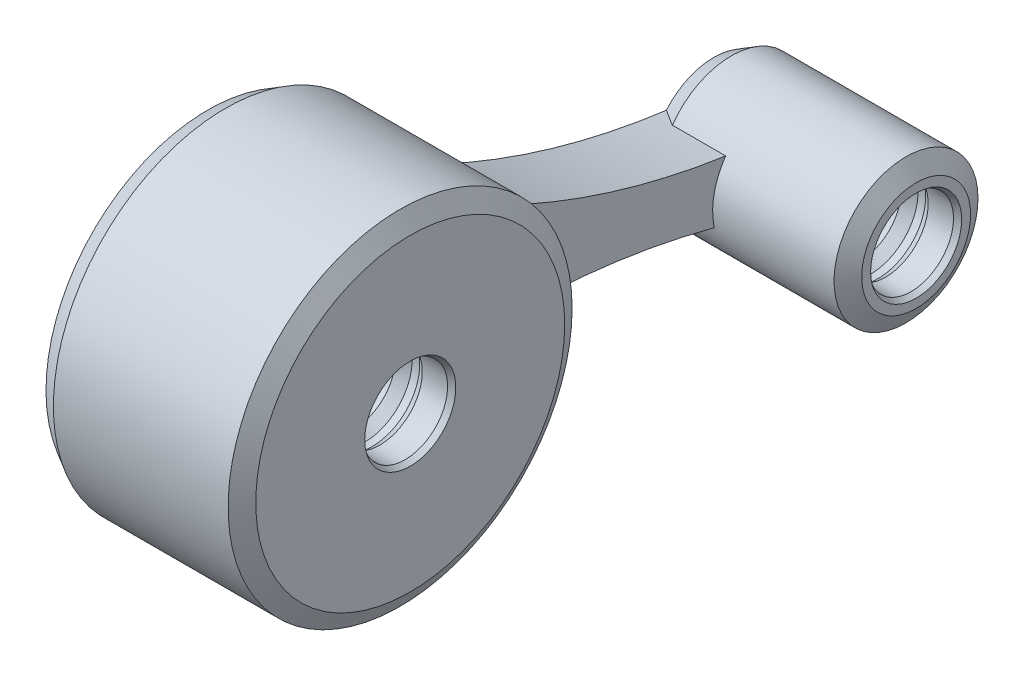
ISO-10303-21;
HEADER;
FILE_DESCRIPTION(('STEP AP214'),'2;1');
FILE_NAME('part.step','',(''),(''),'','','');
FILE_SCHEMA(('AUTOMOTIVE_DESIGN { 1 0 10303 214 1 1 1 1 }'));
ENDSEC;
DATA;
#1=APPLICATION_CONTEXT('core data for automotive mechanical design processes');
#2=APPLICATION_PROTOCOL_DEFINITION('international standard','automotive_design',2000,#1);
#3=PRODUCT_CONTEXT('',#1,'mechanical');
#4=PRODUCT('Part','Part','',(#3));
#5=PRODUCT_RELATED_PRODUCT_CATEGORY('part','',(#4));
#6=PRODUCT_DEFINITION_FORMATION('','',#4);
#7=PRODUCT_DEFINITION_CONTEXT('part definition',#1,'design');
#8=PRODUCT_DEFINITION('design','',#6,#7);
#9=PRODUCT_DEFINITION_SHAPE('','',#8);
#10=(LENGTH_UNIT() NAMED_UNIT(*) SI_UNIT(.MILLI.,.METRE.));
#11=(NAMED_UNIT(*) PLANE_ANGLE_UNIT() SI_UNIT($,.RADIAN.));
#12=(NAMED_UNIT(*) SI_UNIT($,.STERADIAN.) SOLID_ANGLE_UNIT());
#13=UNCERTAINTY_MEASURE_WITH_UNIT(LENGTH_MEASURE(1.E-05),#10,'distance_accuracy_value','');
#14=(GEOMETRIC_REPRESENTATION_CONTEXT(3) GLOBAL_UNCERTAINTY_ASSIGNED_CONTEXT((#13)) GLOBAL_UNIT_ASSIGNED_CONTEXT((#10,
#11,#12)) REPRESENTATION_CONTEXT('',''));
#15=CARTESIAN_POINT('',(0.,0.,0.));
#16=DIRECTION('',(0.,0.,1.));
#17=DIRECTION('',(1.,0.,0.));
#18=AXIS2_PLACEMENT_3D('',#15,#16,#17);
#19=CARTESIAN_POINT('',(20.,0.,0.));
#20=DIRECTION('',(1.,0.,0.));
#21=DIRECTION('',(0.,0.,-1.));
#22=AXIS2_PLACEMENT_3D('',#19,#20,#21);
#23=PLANE('',#22);
#24=CARTESIAN_POINT('',(20.,0.,0.));
#25=DIRECTION('',(1.,0.,0.));
#26=DIRECTION('',(0.,0.,-1.));
#27=AXIS2_PLACEMENT_3D('',#24,#25,#26);
#28=CIRCLE('',#27,5.38218136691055);
#29=CARTESIAN_POINT('',(20.,0.,-5.38218136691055));
#30=VERTEX_POINT('',#29);
#31=EDGE_CURVE('E129',#30,#30,#28,.T.);
#32=ORIENTED_EDGE('',*,*,#31,.T.);
#33=EDGE_LOOP('',(#32));
#34=FACE_BOUND('',#33,.T.);
#35=CARTESIAN_POINT('',(20.,0.,0.));
#36=DIRECTION('',(-1.,0.,0.));
#37=DIRECTION('',(0.,0.,1.));
#38=AXIS2_PLACEMENT_3D('',#35,#36,#37);
#39=CIRCLE('',#38,4.5);
#40=CARTESIAN_POINT('',(20.,0.,4.5));
#41=VERTEX_POINT('',#40);
#42=EDGE_CURVE('E225',#41,#41,#39,.T.);
#43=ORIENTED_EDGE('',*,*,#42,.T.);
#44=EDGE_LOOP('',(#43));
#45=FACE_BOUND('',#44,.T.);
#46=ADVANCED_FACE('F42',(#34,#45),#23,.T.);
#47=CARTESIAN_POINT('',(20.,10.6190847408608,50.));
#48=DIRECTION('',(1.,0.,0.));
#49=DIRECTION('',(0.,0.,-1.));
#50=AXIS2_PLACEMENT_3D('',#47,#48,#49);
#51=PLANE('',#50);
#52=CARTESIAN_POINT('',(20.,10.6190847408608,50.));
#53=DIRECTION('',(1.,0.,0.));
#54=DIRECTION('',(0.,0.,-1.));
#55=AXIS2_PLACEMENT_3D('',#52,#53,#54);
#56=CIRCLE('',#55,15.2679491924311);
#57=CARTESIAN_POINT('',(20.,10.6190847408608,34.7320508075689));
#58=VERTEX_POINT('',#57);
#59=EDGE_CURVE('E188',#58,#58,#56,.T.);
#60=ORIENTED_EDGE('',*,*,#59,.T.);
#61=EDGE_LOOP('',(#60));
#62=FACE_BOUND('',#61,.T.);
#63=CARTESIAN_POINT('',(20.,10.6190847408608,50.));
#64=DIRECTION('',(-1.,0.,0.));
#65=DIRECTION('',(0.,0.,1.));
#66=AXIS2_PLACEMENT_3D('',#63,#64,#65);
#67=CIRCLE('',#66,4.5);
#68=CARTESIAN_POINT('',(20.,10.6190847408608,54.5));
#69=VERTEX_POINT('',#68);
#70=EDGE_CURVE('E260',#69,#69,#67,.T.);
#71=ORIENTED_EDGE('',*,*,#70,.T.);
#72=EDGE_LOOP('',(#71));
#73=FACE_BOUND('',#72,.T.);
#74=ADVANCED_FACE('F222',(#62,#73),#51,.T.);
#75=CARTESIAN_POINT('',(0.,0.,0.));
#76=DIRECTION('',(1.,0.,0.));
#77=DIRECTION('',(0.,0.,-1.));
#78=AXIS2_PLACEMENT_3D('',#75,#76,#77);
#79=PLANE('',#78);
#80=CARTESIAN_POINT('',(0.,10.6190847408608,50.));
#81=DIRECTION('',(-1.,0.,0.));
#82=DIRECTION('',(0.,0.,1.));
#83=AXIS2_PLACEMENT_3D('',#80,#81,#82);
#84=CIRCLE('',#83,4.5);
#85=CARTESIAN_POINT('',(0.,10.6190847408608,54.5));
#86=VERTEX_POINT('',#85);
#87=EDGE_CURVE('E315',#86,#86,#84,.T.);
#88=ORIENTED_EDGE('',*,*,#87,.F.);
#89=EDGE_LOOP('',(#88));
#90=FACE_BOUND('',#89,.T.);
#91=CARTESIAN_POINT('',(0.,-79.2534363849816,27.4855740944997));
#92=DIRECTION('',(-1.,0.,0.));
#93=DIRECTION('',(0.,0.,-1.));
#94=AXIS2_PLACEMENT_3D('',#91,#92,#93);
#95=CIRCLE('',#94,80.4312519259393);
#96=CARTESIAN_POINT('',(0.,0.542951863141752,37.5713417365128));
#97=VERTEX_POINT('',#96);
#98=CARTESIAN_POINT('',(0.,-1.78755789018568,5.84709088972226));
#99=VERTEX_POINT('',#98);
#100=EDGE_CURVE('E105',#97,#99,#95,.T.);
#101=ORIENTED_EDGE('',*,*,#100,.F.);
#102=CARTESIAN_POINT('',(0.,10.6190847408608,50.));
#103=DIRECTION('',(1.,0.,0.));
#104=DIRECTION('',(0.,0.,-1.));
#105=AXIS2_PLACEMENT_3D('',#102,#103,#104);
#106=CIRCLE('',#105,16.);
#107=CARTESIAN_POINT('',(0.,14.5561375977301,34.4919500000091));
#108=VERTEX_POINT('',#107);
#109=EDGE_CURVE('E326',#97,#108,#106,.F.);
#110=ORIENTED_EDGE('',*,*,#109,.T.);
#111=CARTESIAN_POINT('',(0.,78.5679863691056,-5.13014934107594));
#112=DIRECTION('',(-1.,0.,0.));
#113=DIRECTION('',(0.,0.,-1.));
#114=AXIS2_PLACEMENT_3D('',#111,#112,#113);
#115=CIRCLE('',#114,75.2823189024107);
#116=CARTESIAN_POINT('',(0.,3.92829293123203,4.685333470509));
#117=VERTEX_POINT('',#116);
#118=EDGE_CURVE('E67',#117,#108,#115,.T.);
#119=ORIENTED_EDGE('',*,*,#118,.F.);
#120=CARTESIAN_POINT('',(0.,0.,0.));
#121=DIRECTION('',(1.,0.,0.));
#122=DIRECTION('',(0.,0.,-1.));
#123=AXIS2_PLACEMENT_3D('',#120,#121,#122);
#124=CIRCLE('',#123,6.11423217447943);
#125=EDGE_CURVE('E124',#117,#99,#124,.F.);
#126=ORIENTED_EDGE('',*,*,#125,.T.);
#127=EDGE_LOOP('',(#101,#110,#119,#126));
#128=FACE_BOUND('',#127,.T.);
#129=CARTESIAN_POINT('',(0.,0.,0.));
#130=DIRECTION('',(-1.,0.,0.));
#131=DIRECTION('',(0.,0.,1.));
#132=AXIS2_PLACEMENT_3D('',#129,#130,#131);
#133=CIRCLE('',#132,4.5);
#134=CARTESIAN_POINT('',(0.,0.,4.5));
#135=VERTEX_POINT('',#134);
#136=EDGE_CURVE('E287',#135,#135,#133,.T.);
#137=ORIENTED_EDGE('',*,*,#136,.F.);
#138=EDGE_LOOP('',(#137));
#139=FACE_BOUND('',#138,.T.);
#140=ADVANCED_FACE('F131',(#90,#128,#139),#79,.F.);
#141=CARTESIAN_POINT('',(6.99999999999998,39.2839931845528,-2.56507467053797));
#142=DIRECTION('',(1.,0.,0.));
#143=DIRECTION('',(0.,0.,-1.));
#144=AXIS2_PLACEMENT_3D('',#141,#142,#143);
#145=PLANE('',#144);
#146=CARTESIAN_POINT('',(6.99999999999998,78.5679863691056,-5.13014934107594));
#147=DIRECTION('',(-1.,0.,0.));
#148=DIRECTION('',(0.,0.,-1.));
#149=AXIS2_PLACEMENT_3D('',#146,#147,#148);
#150=CIRCLE('',#149,75.2823189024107);
#151=CARTESIAN_POINT('',(6.99999999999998,4.08678037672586,5.82327447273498));
#152=VERTEX_POINT('',#151);
#153=CARTESIAN_POINT('',(6.99999999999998,13.8379888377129,33.3075269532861));
#154=VERTEX_POINT('',#153);
#155=EDGE_CURVE('E117',#152,#154,#150,.T.);
#156=ORIENTED_EDGE('',*,*,#155,.T.);
#157=CARTESIAN_POINT('',(6.99999999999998,10.6190847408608,50.));
#158=DIRECTION('',(1.,0.,0.));
#159=DIRECTION('',(0.,0.,-1.));
#160=AXIS2_PLACEMENT_3D('',#157,#158,#159);
#161=CIRCLE('',#160,17.);
#162=CARTESIAN_POINT('',(6.99999999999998,0.705437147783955,36.1898735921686));
#163=VERTEX_POINT('',#162);
#164=EDGE_CURVE('E187',#154,#163,#161,.F.);
#165=ORIENTED_EDGE('',*,*,#164,.T.);
#166=CARTESIAN_POINT('',(6.99999999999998,-79.2534363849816,27.4855740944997));
#167=DIRECTION('',(-1.,0.,0.));
#168=DIRECTION('',(0.,0.,-1.));
#169=AXIS2_PLACEMENT_3D('',#166,#167,#168);
#170=CIRCLE('',#169,80.4312519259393);
#171=CARTESIAN_POINT('',(6.99999999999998,-1.48598416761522,6.95730914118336));
#172=VERTEX_POINT('',#171);
#173=EDGE_CURVE('E198',#163,#172,#170,.T.);
#174=ORIENTED_EDGE('',*,*,#173,.T.);
#175=CARTESIAN_POINT('',(6.99999999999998,0.,0.));
#176=DIRECTION('',(1.,0.,0.));
#177=DIRECTION('',(0.,0.,-1.));
#178=AXIS2_PLACEMENT_3D('',#175,#176,#177);
#179=CIRCLE('',#178,7.11423217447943);
#180=EDGE_CURVE('E170',#152,#172,#179,.T.);
#181=ORIENTED_EDGE('',*,*,#180,.F.);
#182=EDGE_LOOP('',(#156,#165,#174,#181));
#183=FACE_BOUND('',#182,.T.);
#184=ADVANCED_FACE('F160',(#183),#145,.T.);
#185=CARTESIAN_POINT('',(6.99999999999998,78.5679863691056,-5.13014934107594));
#186=DIRECTION('',(-1.,0.,0.));
#187=DIRECTION('',(0.,0.,1.));
#188=AXIS2_PLACEMENT_3D('',#185,#186,#187);
#189=CYLINDRICAL_SURFACE('',#188,75.2823189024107);
#190=DIRECTION('',(-1.,0.,0.));
#191=VECTOR('',#190,1.);
#192=CARTESIAN_POINT('',(10.3660254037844,13.837988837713,33.3075269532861));
#193=LINE('',#192,#191);
#194=CARTESIAN_POINT('',(1.73205080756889,13.8379888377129,33.3075269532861));
#195=VERTEX_POINT('',#194);
#196=EDGE_CURVE('E192',#154,#195,#193,.T.);
#197=ORIENTED_EDGE('',*,*,#196,.F.);
#198=ORIENTED_EDGE('',*,*,#155,.F.);
#199=DIRECTION('',(-1.,0.,0.));
#200=VECTOR('',#199,1.);
#201=CARTESIAN_POINT('',(3.49999999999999,4.08678037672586,5.82327447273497));
#202=LINE('',#201,#200);
#203=CARTESIAN_POINT('',(1.73205080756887,4.08678037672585,5.82327447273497));
#204=VERTEX_POINT('',#203);
#205=EDGE_CURVE('E206',#152,#204,#202,.T.);
#206=ORIENTED_EDGE('',*,*,#205,.T.);
#207=CARTESIAN_POINT('',(-0.000199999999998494,3.92827508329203,4.68519774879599));
#208=CARTESIAN_POINT('',(0.142778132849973,3.94103367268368,4.78221572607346));
#209=CARTESIAN_POINT('',(0.286177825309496,3.95389989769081,4.87859542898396));
#210=CARTESIAN_POINT('',(0.573701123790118,3.97985534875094,5.0702239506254));
#211=CARTESIAN_POINT('',(0.717824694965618,3.99294456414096,5.16547282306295));
#212=CARTESIAN_POINT('',(1.00668894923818,4.01935482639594,5.35499375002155));
#213=CARTESIAN_POINT('',(1.15142962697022,4.03267587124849,5.44926581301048));
#214=CARTESIAN_POINT('',(1.4414546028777,4.0595568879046,5.6369511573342));
#215=CARTESIAN_POINT('',(1.58673892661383,4.07311687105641,5.73036439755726));
#216=CARTESIAN_POINT('',(1.73225080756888,4.08679918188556,5.82340234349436));
#217=B_SPLINE_CURVE_WITH_KNOTS('',3,(#207,#208,#209,#210,#211,#212,#213,#214,#215,#216),
.UNSPECIFIED.,.F.,.F.,(4,2,2,2,4),(0.,0.51976722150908,1.03950965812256,1.55924758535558,
2.07901026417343),.UNSPECIFIED.);
#218=EDGE_CURVE('E128',#117,#204,#217,.T.);
#219=ORIENTED_EDGE('',*,*,#218,.F.);
#220=ORIENTED_EDGE('',*,*,#118,.T.);
#221=CARTESIAN_POINT('',(-0.000200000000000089,14.5562250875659,34.4920913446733));
#222=CARTESIAN_POINT('',(0.141981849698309,14.4940295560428,34.3916105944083));
#223=CARTESIAN_POINT('',(0.28477998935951,14.4324615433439,34.2916163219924));
#224=CARTESIAN_POINT('',(0.571493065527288,14.3105184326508,34.092535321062));
#225=CARTESIAN_POINT('',(0.715407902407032,14.2501432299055,33.9934485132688));
#226=CARTESIAN_POINT('',(1.00426270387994,14.1305130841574,33.7961000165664));
#227=CARTESIAN_POINT('',(1.14920266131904,14.0712581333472,33.6978383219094));
#228=CARTESIAN_POINT('',(1.44003606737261,13.9538047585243,33.5020664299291));
#229=CARTESIAN_POINT('',(1.58592959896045,13.8956064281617,33.4045562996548));
#230=CARTESIAN_POINT('',(1.7322508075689,13.8379099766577,33.3073941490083));
#231=B_SPLINE_CURVE_WITH_KNOTS('',3,(#221,#222,#223,#224,#225,#226,#227,#228,#229,#230),
.UNSPECIFIED.,.F.,.F.,(4,2,2,2,4),(0.,0.554632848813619,1.10921677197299,1.66379682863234,
2.21842580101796),.UNSPECIFIED.);
#232=EDGE_CURVE('E61',#108,#195,#231,.T.);
#233=ORIENTED_EDGE('',*,*,#232,.T.);
#234=EDGE_LOOP('',(#197,#198,#206,#219,#220,#233));
#235=FACE_BOUND('',#234,.T.);
#236=ADVANCED_FACE('F159',(#235),#189,.F.);
#237=CARTESIAN_POINT('',(6.99999999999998,-79.2534363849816,27.4855740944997));
#238=DIRECTION('',(-1.,0.,0.));
#239=DIRECTION('',(0.,0.,1.));
#240=AXIS2_PLACEMENT_3D('',#237,#238,#239);
#241=CYLINDRICAL_SURFACE('',#240,80.4312519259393);
#242=DIRECTION('',(-1.,0.,0.));
#243=VECTOR('',#242,1.);
#244=CARTESIAN_POINT('',(10.3660254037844,0.705437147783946,36.1898735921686));
#245=LINE('',#244,#243);
#246=CARTESIAN_POINT('',(1.73205080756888,0.705437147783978,36.1898735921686));
#247=VERTEX_POINT('',#246);
#248=EDGE_CURVE('E11',#247,#163,#245,.F.);
#249=ORIENTED_EDGE('',*,*,#248,.F.);
#250=CARTESIAN_POINT('',(1.7322508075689,0.70545393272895,36.1897194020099));
#251=CARTESIAN_POINT('',(1.58591737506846,0.693172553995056,36.3025373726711));
#252=CARTESIAN_POINT('',(1.44001447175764,0.680592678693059,36.4158829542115));
#253=CARTESIAN_POINT('',(1.14916825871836,0.654811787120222,36.6437022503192));
#254=CARTESIAN_POINT('',(1.00422486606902,0.641610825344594,36.7581758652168));
#255=CARTESIAN_POINT('',(0.715369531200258,0.614561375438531,36.9883446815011));
#256=CARTESIAN_POINT('',(0.571457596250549,0.60071288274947,37.1040398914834));
#257=CARTESIAN_POINT('',(0.284757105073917,0.572337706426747,37.3367570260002));
#258=CARTESIAN_POINT('',(0.14196864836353,0.557810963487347,37.453779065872));
#259=CARTESIAN_POINT('',(-0.00019999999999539,0.54293092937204,37.5715073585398));
#260=B_SPLINE_CURVE_WITH_KNOTS('',3,(#250,#251,#252,#253,#254,#255,#256,#257,#258,#259),
.UNSPECIFIED.,.F.,.F.,(4,2,2,2,4),(0.,0.555544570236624,1.11104048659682,1.66654031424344,
2.22208880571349),.UNSPECIFIED.);
#261=EDGE_CURVE('E51',#247,#97,#260,.T.);
#262=ORIENTED_EDGE('',*,*,#261,.T.);
#263=ORIENTED_EDGE('',*,*,#100,.T.);
#264=CARTESIAN_POINT('',(1.73225080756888,-1.48595113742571,6.95743427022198));
#265=CARTESIAN_POINT('',(1.58673608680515,-1.50998433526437,6.86638948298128));
#266=CARTESIAN_POINT('',(1.44144955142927,-1.53426725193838,6.77504447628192));
#267=CARTESIAN_POINT('',(1.15142147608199,-1.58336930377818,6.59165185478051));
#268=CARTESIAN_POINT('',(1.00667991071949,-1.60818841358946,6.49960427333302));
#269=CARTESIAN_POINT('',(0.717815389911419,-1.65840211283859,6.314694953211));
#270=CARTESIAN_POINT('',(0.573692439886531,-1.68379670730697,6.2218332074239));
#271=CARTESIAN_POINT('',(0.286172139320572,-1.73521300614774,6.03515014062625));
#272=CARTESIAN_POINT('',(0.142774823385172,-1.7612347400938,5.94132877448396));
#273=CARTESIAN_POINT('',(-0.000199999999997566,-1.78759476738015,5.84695886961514));
#274=B_SPLINE_CURVE_WITH_KNOTS('',3,(#264,#265,#266,#267,#268,#269,#270,#271,#272,#273),
.UNSPECIFIED.,.F.,.F.,(4,2,2,2,4),(0.,0.519973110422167,1.03992168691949,1.55987481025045,
2.07985250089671),.UNSPECIFIED.);
#275=CARTESIAN_POINT('',(1.73205080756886,-1.4859841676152,6.95730914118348));
#276=VERTEX_POINT('',#275);
#277=EDGE_CURVE('E109',#276,#99,#274,.T.);
#278=ORIENTED_EDGE('',*,*,#277,.F.);
#279=DIRECTION('',(-1.,0.,0.));
#280=VECTOR('',#279,1.);
#281=CARTESIAN_POINT('',(4.36602540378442,-1.4859841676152,6.95730914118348));
#282=LINE('',#281,#280);
#283=EDGE_CURVE('E201',#276,#172,#282,.F.);
#284=ORIENTED_EDGE('',*,*,#283,.T.);
#285=ORIENTED_EDGE('',*,*,#173,.F.);
#286=EDGE_LOOP('',(#249,#262,#263,#278,#284,#285));
#287=FACE_BOUND('',#286,.T.);
#288=ADVANCED_FACE('F107',(#287),#241,.F.);
#289=CARTESIAN_POINT('',(20.,0.,0.));
#290=DIRECTION('',(-1.,0.,0.));
#291=DIRECTION('',(0.,0.,1.));
#292=AXIS2_PLACEMENT_3D('',#289,#290,#291);
#293=CYLINDRICAL_SURFACE('',#292,7.11423217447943);
#294=CARTESIAN_POINT('',(19.,0.,0.));
#295=DIRECTION('',(1.,0.,0.));
#296=DIRECTION('',(0.,0.,-1.));
#297=AXIS2_PLACEMENT_3D('',#294,#295,#296);
#298=CIRCLE('',#297,7.11423217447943);
#299=CARTESIAN_POINT('',(19.,0.,-7.11423217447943));
#300=VERTEX_POINT('',#299);
#301=EDGE_CURVE('E140',#300,#300,#298,.F.);
#302=ORIENTED_EDGE('',*,*,#301,.T.);
#303=EDGE_LOOP('',(#302));
#304=FACE_BOUND('',#303,.T.);
#305=ORIENTED_EDGE('',*,*,#205,.F.);
#306=ORIENTED_EDGE('',*,*,#180,.T.);
#307=ORIENTED_EDGE('',*,*,#283,.F.);
#308=CARTESIAN_POINT('',(1.73205080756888,0.,0.));
#309=DIRECTION('',(1.,0.,0.));
#310=DIRECTION('',(0.,0.,-1.));
#311=AXIS2_PLACEMENT_3D('',#308,#309,#310);
#312=CIRCLE('',#311,7.11423217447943);
#313=EDGE_CURVE('E126',#276,#204,#312,.T.);
#314=ORIENTED_EDGE('',*,*,#313,.T.);
#315=EDGE_LOOP('',(#305,#306,#307,#314));
#316=FACE_BOUND('',#315,.T.);
#317=ADVANCED_FACE('F158',(#304,#316),#293,.T.);
#318=CARTESIAN_POINT('',(1.73205080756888,0.,0.));
#319=DIRECTION('',(1.,0.,0.));
#320=DIRECTION('',(0.,0.,-1.));
#321=AXIS2_PLACEMENT_3D('',#318,#319,#320);
#322=CONICAL_SURFACE('',#321,7.11423217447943,0.523598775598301);
#323=ORIENTED_EDGE('',*,*,#125,.F.);
#324=ORIENTED_EDGE('',*,*,#218,.T.);
#325=ORIENTED_EDGE('',*,*,#313,.F.);
#326=ORIENTED_EDGE('',*,*,#277,.T.);
#327=EDGE_LOOP('',(#323,#324,#325,#326));
#328=FACE_BOUND('',#327,.T.);
#329=ADVANCED_FACE('F122',(#328),#322,.T.);
#330=CARTESIAN_POINT('',(20.,0.,0.));
#331=DIRECTION('',(-1.,0.,0.));
#332=DIRECTION('',(0.,0.,1.));
#333=AXIS2_PLACEMENT_3D('',#330,#331,#332);
#334=CONICAL_SURFACE('',#333,5.38218136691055,1.0471975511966);
#335=ORIENTED_EDGE('',*,*,#301,.F.);
#336=EDGE_LOOP('',(#335));
#337=FACE_BOUND('',#336,.T.);
#338=ORIENTED_EDGE('',*,*,#31,.F.);
#339=EDGE_LOOP('',(#338));
#340=FACE_BOUND('',#339,.T.);
#341=ADVANCED_FACE('F44',(#337,#340),#334,.T.);
#342=CARTESIAN_POINT('',(20.,10.6190847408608,50.));
#343=DIRECTION('',(-1.,0.,0.));
#344=DIRECTION('',(0.,0.,1.));
#345=AXIS2_PLACEMENT_3D('',#342,#343,#344);
#346=CYLINDRICAL_SURFACE('',#345,17.);
#347=CARTESIAN_POINT('',(19.,10.6190847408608,50.));
#348=DIRECTION('',(1.,0.,0.));
#349=DIRECTION('',(0.,0.,-1.));
#350=AXIS2_PLACEMENT_3D('',#347,#348,#349);
#351=CIRCLE('',#350,17.);
#352=CARTESIAN_POINT('',(19.,10.6190847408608,33.));
#353=VERTEX_POINT('',#352);
#354=EDGE_CURVE('E319',#353,#353,#351,.F.);
#355=ORIENTED_EDGE('',*,*,#354,.T.);
#356=EDGE_LOOP('',(#355));
#357=FACE_BOUND('',#356,.T.);
#358=ORIENTED_EDGE('',*,*,#164,.F.);
#359=ORIENTED_EDGE('',*,*,#196,.T.);
#360=CARTESIAN_POINT('',(1.7320508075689,10.6190847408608,50.));
#361=DIRECTION('',(1.,0.,0.));
#362=DIRECTION('',(0.,0.,-1.));
#363=AXIS2_PLACEMENT_3D('',#360,#361,#362);
#364=CIRCLE('',#363,17.);
#365=EDGE_CURVE('E323',#195,#247,#364,.T.);
#366=ORIENTED_EDGE('',*,*,#365,.T.);
#367=ORIENTED_EDGE('',*,*,#248,.T.);
#368=EDGE_LOOP('',(#358,#359,#366,#367));
#369=FACE_BOUND('',#368,.T.);
#370=ADVANCED_FACE('F176',(#357,#369),#346,.T.);
#371=CARTESIAN_POINT('',(1.7320508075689,10.6190847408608,50.));
#372=DIRECTION('',(1.,0.,0.));
#373=DIRECTION('',(0.,0.,-1.));
#374=AXIS2_PLACEMENT_3D('',#371,#372,#373);
#375=CONICAL_SURFACE('',#374,17.,0.523598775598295);
#376=ORIENTED_EDGE('',*,*,#232,.F.);
#377=ORIENTED_EDGE('',*,*,#109,.F.);
#378=ORIENTED_EDGE('',*,*,#261,.F.);
#379=ORIENTED_EDGE('',*,*,#365,.F.);
#380=EDGE_LOOP('',(#376,#377,#378,#379));
#381=FACE_BOUND('',#380,.T.);
#382=ADVANCED_FACE('F171',(#381),#375,.T.);
#383=CARTESIAN_POINT('',(20.,10.6190847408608,50.));
#384=DIRECTION('',(-1.,0.,0.));
#385=DIRECTION('',(0.,0.,1.));
#386=AXIS2_PLACEMENT_3D('',#383,#384,#385);
#387=CONICAL_SURFACE('',#386,15.2679491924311,1.0471975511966);
#388=ORIENTED_EDGE('',*,*,#354,.F.);
#389=EDGE_LOOP('',(#388));
#390=FACE_BOUND('',#389,.T.);
#391=ORIENTED_EDGE('',*,*,#59,.F.);
#392=EDGE_LOOP('',(#391));
#393=FACE_BOUND('',#392,.T.);
#394=ADVANCED_FACE('F175',(#390,#393),#387,.T.);
#395=CARTESIAN_POINT('',(0.499999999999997,10.6190847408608,50.));
#396=DIRECTION('',(-1.,0.,0.));
#397=DIRECTION('',(0.,0.,1.));
#398=AXIS2_PLACEMENT_3D('',#395,#396,#397);
#399=CONICAL_SURFACE('',#398,4.1916419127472,0.552620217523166);
#400=ORIENTED_EDGE('',*,*,#87,.T.);
#401=EDGE_LOOP('',(#400));
#402=FACE_BOUND('',#401,.T.);
#403=CARTESIAN_POINT('',(0.499999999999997,10.6190847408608,50.));
#404=DIRECTION('',(-1.,0.,0.));
#405=DIRECTION('',(0.,0.,1.));
#406=AXIS2_PLACEMENT_3D('',#403,#404,#405);
#407=CIRCLE('',#406,4.1916419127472);
#408=CARTESIAN_POINT('',(0.499999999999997,10.6190847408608,54.1916419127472));
#409=VERTEX_POINT('',#408);
#410=EDGE_CURVE('E291',#409,#409,#407,.T.);
#411=ORIENTED_EDGE('',*,*,#410,.F.);
#412=EDGE_LOOP('',(#411));
#413=FACE_BOUND('',#412,.T.);
#414=ADVANCED_FACE('F335',(#402,#413),#399,.F.);
#415=CARTESIAN_POINT('',(5.99999999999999,10.6190847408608,50.));
#416=DIRECTION('',(-1.,0.,0.));
#417=DIRECTION('',(0.,0.,1.));
#418=AXIS2_PLACEMENT_3D('',#415,#416,#417);
#419=PLANE('',#418);
#420=CARTESIAN_POINT('',(5.99999999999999,10.6190847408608,50.));
#421=DIRECTION('',(-1.,0.,0.));
#422=DIRECTION('',(0.,0.,1.));
#423=AXIS2_PLACEMENT_3D('',#420,#421,#422);
#424=CIRCLE('',#423,3.99164191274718);
#425=CARTESIAN_POINT('',(5.99999999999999,10.6190847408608,53.9916419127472));
#426=VERTEX_POINT('',#425);
#427=EDGE_CURVE('E311',#426,#426,#424,.T.);
#428=ORIENTED_EDGE('',*,*,#427,.T.);
#429=EDGE_LOOP('',(#428));
#430=FACE_BOUND('',#429,.T.);
#431=ADVANCED_FACE('F340',(#430),#419,.T.);
#432=CARTESIAN_POINT('',(0.,10.6190847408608,50.));
#433=DIRECTION('',(-1.,0.,0.));
#434=DIRECTION('',(0.,0.,1.));
#435=AXIS2_PLACEMENT_3D('',#432,#433,#434);
#436=CYLINDRICAL_SURFACE('',#435,3.99164191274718);
#437=CARTESIAN_POINT('',(5.46561999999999,10.6190847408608,50.));
#438=DIRECTION('',(-1.,0.,0.));
#439=DIRECTION('',(0.,0.,1.));
#440=AXIS2_PLACEMENT_3D('',#437,#438,#439);
#441=CIRCLE('',#440,3.99164191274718);
#442=CARTESIAN_POINT('',(5.46561999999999,10.6190847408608,53.9916419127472));
#443=VERTEX_POINT('',#442);
#444=EDGE_CURVE('E307',#443,#443,#441,.T.);
#445=ORIENTED_EDGE('',*,*,#444,.T.);
#446=EDGE_LOOP('',(#445));
#447=FACE_BOUND('',#446,.T.);
#448=ORIENTED_EDGE('',*,*,#427,.F.);
#449=EDGE_LOOP('',(#448));
#450=FACE_BOUND('',#449,.T.);
#451=ADVANCED_FACE('F577',(#447,#450),#436,.F.);
#452=CARTESIAN_POINT('',(5.46561999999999,10.6190847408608,50.));
#453=DIRECTION('',(-1.,0.,0.));
#454=DIRECTION('',(0.,0.,1.));
#455=AXIS2_PLACEMENT_3D('',#452,#453,#454);
#456=CONICAL_SURFACE('',#455,3.99164191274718,0.627257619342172);
#457=CARTESIAN_POINT('',(4.49999999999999,10.6190847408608,50.));
#458=DIRECTION('',(-1.,0.,0.));
#459=DIRECTION('',(0.,0.,1.));
#460=AXIS2_PLACEMENT_3D('',#457,#458,#459);
#461=CIRCLE('',#460,4.69164191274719);
#462=CARTESIAN_POINT('',(4.49999999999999,10.6190847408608,54.6916419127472));
#463=VERTEX_POINT('',#462);
#464=EDGE_CURVE('E303',#463,#463,#461,.T.);
#465=ORIENTED_EDGE('',*,*,#464,.T.);
#466=EDGE_LOOP('',(#465));
#467=FACE_BOUND('',#466,.T.);
#468=ORIENTED_EDGE('',*,*,#444,.F.);
#469=EDGE_LOOP('',(#468));
#470=FACE_BOUND('',#469,.T.);
#471=ADVANCED_FACE('F586',(#467,#470),#456,.F.);
#472=CARTESIAN_POINT('',(0.,10.6190847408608,50.));
#473=DIRECTION('',(-1.,0.,0.));
#474=DIRECTION('',(0.,0.,1.));
#475=AXIS2_PLACEMENT_3D('',#472,#473,#474);
#476=CYLINDRICAL_SURFACE('',#475,4.69164191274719);
#477=CARTESIAN_POINT('',(3.74999999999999,10.6190847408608,50.));
#478=DIRECTION('',(-1.,0.,0.));
#479=DIRECTION('',(0.,0.,1.));
#480=AXIS2_PLACEMENT_3D('',#477,#478,#479);
#481=CIRCLE('',#480,4.69164191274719);
#482=CARTESIAN_POINT('',(3.74999999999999,10.6190847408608,54.6916419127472));
#483=VERTEX_POINT('',#482);
#484=EDGE_CURVE('E299',#483,#483,#481,.T.);
#485=ORIENTED_EDGE('',*,*,#484,.T.);
#486=EDGE_LOOP('',(#485));
#487=FACE_BOUND('',#486,.T.);
#488=ORIENTED_EDGE('',*,*,#464,.F.);
#489=EDGE_LOOP('',(#488));
#490=FACE_BOUND('',#489,.T.);
#491=ADVANCED_FACE('F595',(#487,#490),#476,.F.);
#492=CARTESIAN_POINT('',(3.74999999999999,10.6190847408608,50.));
#493=DIRECTION('',(1.,0.,0.));
#494=DIRECTION('',(0.,0.,-1.));
#495=AXIS2_PLACEMENT_3D('',#492,#493,#494);
#496=CONICAL_SURFACE('',#495,4.69164191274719,0.588002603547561);
#497=CARTESIAN_POINT('',(3.,10.6190847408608,50.));
#498=DIRECTION('',(-1.,0.,0.));
#499=DIRECTION('',(0.,0.,1.));
#500=AXIS2_PLACEMENT_3D('',#497,#498,#499);
#501=CIRCLE('',#500,4.1916419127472);
#502=CARTESIAN_POINT('',(3.,10.6190847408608,54.1916419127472));
#503=VERTEX_POINT('',#502);
#504=EDGE_CURVE('E295',#503,#503,#501,.T.);
#505=ORIENTED_EDGE('',*,*,#504,.T.);
#506=EDGE_LOOP('',(#505));
#507=FACE_BOUND('',#506,.T.);
#508=ORIENTED_EDGE('',*,*,#484,.F.);
#509=EDGE_LOOP('',(#508));
#510=FACE_BOUND('',#509,.T.);
#511=ADVANCED_FACE('F521',(#507,#510),#496,.F.);
#512=CARTESIAN_POINT('',(0.,10.6190847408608,50.));
#513=DIRECTION('',(-1.,0.,0.));
#514=DIRECTION('',(0.,0.,1.));
#515=AXIS2_PLACEMENT_3D('',#512,#513,#514);
#516=CYLINDRICAL_SURFACE('',#515,4.1916419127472);
#517=ORIENTED_EDGE('',*,*,#410,.T.);
#518=EDGE_LOOP('',(#517));
#519=FACE_BOUND('',#518,.T.);
#520=ORIENTED_EDGE('',*,*,#504,.F.);
#521=EDGE_LOOP('',(#520));
#522=FACE_BOUND('',#521,.T.);
#523=ADVANCED_FACE('F518',(#519,#522),#516,.F.);
#524=CARTESIAN_POINT('',(0.499999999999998,0.,0.));
#525=DIRECTION('',(-1.,0.,0.));
#526=DIRECTION('',(0.,0.,1.));
#527=AXIS2_PLACEMENT_3D('',#524,#525,#526);
#528=CONICAL_SURFACE('',#527,4.19164191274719,0.552620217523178);
#529=ORIENTED_EDGE('',*,*,#136,.T.);
#530=EDGE_LOOP('',(#529));
#531=FACE_BOUND('',#530,.T.);
#532=CARTESIAN_POINT('',(0.499999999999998,0.,0.));
#533=DIRECTION('',(-1.,0.,0.));
#534=DIRECTION('',(0.,0.,1.));
#535=AXIS2_PLACEMENT_3D('',#532,#533,#534);
#536=CIRCLE('',#535,4.19164191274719);
#537=CARTESIAN_POINT('',(0.499999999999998,0.,4.19164191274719));
#538=VERTEX_POINT('',#537);
#539=EDGE_CURVE('E264',#538,#538,#536,.T.);
#540=ORIENTED_EDGE('',*,*,#539,.F.);
#541=EDGE_LOOP('',(#540));
#542=FACE_BOUND('',#541,.T.);
#543=ADVANCED_FACE('F520',(#531,#542),#528,.F.);
#544=CARTESIAN_POINT('',(5.99999999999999,0.,0.));
#545=DIRECTION('',(-1.,0.,0.));
#546=DIRECTION('',(0.,0.,1.));
#547=AXIS2_PLACEMENT_3D('',#544,#545,#546);
#548=PLANE('',#547);
#549=CARTESIAN_POINT('',(5.99999999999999,0.,0.));
#550=DIRECTION('',(-1.,0.,0.));
#551=DIRECTION('',(0.,0.,1.));
#552=AXIS2_PLACEMENT_3D('',#549,#550,#551);
#553=CIRCLE('',#552,3.99164191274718);
#554=CARTESIAN_POINT('',(5.99999999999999,0.,3.99164191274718));
#555=VERTEX_POINT('',#554);
#556=EDGE_CURVE('E283',#555,#555,#553,.T.);
#557=ORIENTED_EDGE('',*,*,#556,.T.);
#558=EDGE_LOOP('',(#557));
#559=FACE_BOUND('',#558,.T.);
#560=ADVANCED_FACE('F626',(#559),#548,.T.);
#561=CARTESIAN_POINT('',(0.,0.,0.));
#562=DIRECTION('',(-1.,0.,0.));
#563=DIRECTION('',(0.,0.,1.));
#564=AXIS2_PLACEMENT_3D('',#561,#562,#563);
#565=CYLINDRICAL_SURFACE('',#564,3.99164191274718);
#566=CARTESIAN_POINT('',(5.46561999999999,0.,0.));
#567=DIRECTION('',(-1.,0.,0.));
#568=DIRECTION('',(0.,0.,1.));
#569=AXIS2_PLACEMENT_3D('',#566,#567,#568);
#570=CIRCLE('',#569,3.99164191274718);
#571=CARTESIAN_POINT('',(5.46561999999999,0.,3.99164191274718));
#572=VERTEX_POINT('',#571);
#573=EDGE_CURVE('E279',#572,#572,#570,.T.);
#574=ORIENTED_EDGE('',*,*,#573,.T.);
#575=EDGE_LOOP('',(#574));
#576=FACE_BOUND('',#575,.T.);
#577=ORIENTED_EDGE('',*,*,#556,.F.);
#578=EDGE_LOOP('',(#577));
#579=FACE_BOUND('',#578,.T.);
#580=ADVANCED_FACE('F635',(#576,#579),#565,.F.);
#581=CARTESIAN_POINT('',(5.46561999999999,0.,0.));
#582=DIRECTION('',(-1.,0.,0.));
#583=DIRECTION('',(0.,0.,1.));
#584=AXIS2_PLACEMENT_3D('',#581,#582,#583);
#585=CONICAL_SURFACE('',#584,3.99164191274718,0.627257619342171);
#586=CARTESIAN_POINT('',(4.49999999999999,0.,0.));
#587=DIRECTION('',(-1.,0.,0.));
#588=DIRECTION('',(0.,0.,1.));
#589=AXIS2_PLACEMENT_3D('',#586,#587,#588);
#590=CIRCLE('',#589,4.69164191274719);
#591=CARTESIAN_POINT('',(4.49999999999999,0.,4.69164191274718));
#592=VERTEX_POINT('',#591);
#593=EDGE_CURVE('E275',#592,#592,#590,.T.);
#594=ORIENTED_EDGE('',*,*,#593,.T.);
#595=EDGE_LOOP('',(#594));
#596=FACE_BOUND('',#595,.T.);
#597=ORIENTED_EDGE('',*,*,#573,.F.);
#598=EDGE_LOOP('',(#597));
#599=FACE_BOUND('',#598,.T.);
#600=ADVANCED_FACE('F644',(#596,#599),#585,.F.);
#601=CARTESIAN_POINT('',(0.,0.,0.));
#602=DIRECTION('',(-1.,0.,0.));
#603=DIRECTION('',(0.,0.,1.));
#604=AXIS2_PLACEMENT_3D('',#601,#602,#603);
#605=CYLINDRICAL_SURFACE('',#604,4.69164191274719);
#606=CARTESIAN_POINT('',(3.74999999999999,0.,0.));
#607=DIRECTION('',(-1.,0.,0.));
#608=DIRECTION('',(0.,0.,1.));
#609=AXIS2_PLACEMENT_3D('',#606,#607,#608);
#610=CIRCLE('',#609,4.69164191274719);
#611=CARTESIAN_POINT('',(3.74999999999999,0.,4.69164191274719));
#612=VERTEX_POINT('',#611);
#613=EDGE_CURVE('E271',#612,#612,#610,.T.);
#614=ORIENTED_EDGE('',*,*,#613,.T.);
#615=EDGE_LOOP('',(#614));
#616=FACE_BOUND('',#615,.T.);
#617=ORIENTED_EDGE('',*,*,#593,.F.);
#618=EDGE_LOOP('',(#617));
#619=FACE_BOUND('',#618,.T.);
#620=ADVANCED_FACE('F653',(#616,#619),#605,.F.);
#621=CARTESIAN_POINT('',(3.74999999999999,0.,0.));
#622=DIRECTION('',(1.,0.,0.));
#623=DIRECTION('',(0.,0.,-1.));
#624=AXIS2_PLACEMENT_3D('',#621,#622,#623);
#625=CONICAL_SURFACE('',#624,4.69164191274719,0.588002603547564);
#626=CARTESIAN_POINT('',(3.,0.,0.));
#627=DIRECTION('',(-1.,0.,0.));
#628=DIRECTION('',(0.,0.,1.));
#629=AXIS2_PLACEMENT_3D('',#626,#627,#628);
#630=CIRCLE('',#629,4.19164191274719);
#631=CARTESIAN_POINT('',(3.,0.,4.19164191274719));
#632=VERTEX_POINT('',#631);
#633=EDGE_CURVE('E267',#632,#632,#630,.T.);
#634=ORIENTED_EDGE('',*,*,#633,.T.);
#635=EDGE_LOOP('',(#634));
#636=FACE_BOUND('',#635,.T.);
#637=ORIENTED_EDGE('',*,*,#613,.F.);
#638=EDGE_LOOP('',(#637));
#639=FACE_BOUND('',#638,.T.);
#640=ADVANCED_FACE('F662',(#636,#639),#625,.F.);
#641=CARTESIAN_POINT('',(0.,0.,0.));
#642=DIRECTION('',(-1.,0.,0.));
#643=DIRECTION('',(0.,0.,1.));
#644=AXIS2_PLACEMENT_3D('',#641,#642,#643);
#645=CYLINDRICAL_SURFACE('',#644,4.19164191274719);
#646=ORIENTED_EDGE('',*,*,#539,.T.);
#647=EDGE_LOOP('',(#646));
#648=FACE_BOUND('',#647,.T.);
#649=ORIENTED_EDGE('',*,*,#633,.F.);
#650=EDGE_LOOP('',(#649));
#651=FACE_BOUND('',#650,.T.);
#652=ADVANCED_FACE('F671',(#648,#651),#645,.F.);
#653=CARTESIAN_POINT('',(19.5,10.6190847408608,50.));
#654=DIRECTION('',(1.,0.,0.));
#655=DIRECTION('',(0.,0.,1.));
#656=AXIS2_PLACEMENT_3D('',#653,#654,#655);
#657=CONICAL_SURFACE('',#656,4.1916419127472,0.552620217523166);
#658=ORIENTED_EDGE('',*,*,#70,.F.);
#659=EDGE_LOOP('',(#658));
#660=FACE_BOUND('',#659,.T.);
#661=CARTESIAN_POINT('',(19.5,10.6190847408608,50.));
#662=DIRECTION('',(-1.,0.,0.));
#663=DIRECTION('',(0.,0.,1.));
#664=AXIS2_PLACEMENT_3D('',#661,#662,#663);
#665=CIRCLE('',#664,4.1916419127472);
#666=CARTESIAN_POINT('',(19.5,10.6190847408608,54.1916419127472));
#667=VERTEX_POINT('',#666);
#668=EDGE_CURVE('E228',#667,#667,#665,.T.);
#669=ORIENTED_EDGE('',*,*,#668,.T.);
#670=EDGE_LOOP('',(#669));
#671=FACE_BOUND('',#670,.T.);
#672=ADVANCED_FACE('F678',(#660,#671),#657,.F.);
#673=CARTESIAN_POINT('',(14.,10.6190847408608,50.));
#674=DIRECTION('',(1.,0.,0.));
#675=DIRECTION('',(0.,0.,1.));
#676=AXIS2_PLACEMENT_3D('',#673,#674,#675);
#677=PLANE('',#676);
#678=CARTESIAN_POINT('',(14.,10.6190847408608,50.));
#679=DIRECTION('',(-1.,0.,0.));
#680=DIRECTION('',(0.,0.,1.));
#681=AXIS2_PLACEMENT_3D('',#678,#679,#680);
#682=CIRCLE('',#681,3.99164191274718);
#683=CARTESIAN_POINT('',(14.,10.6190847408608,53.9916419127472));
#684=VERTEX_POINT('',#683);
#685=EDGE_CURVE('E256',#684,#684,#682,.T.);
#686=ORIENTED_EDGE('',*,*,#685,.F.);
#687=EDGE_LOOP('',(#686));
#688=FACE_BOUND('',#687,.T.);
#689=ADVANCED_FACE('F689',(#688),#677,.T.);
#690=CARTESIAN_POINT('',(20.,10.6190847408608,50.));
#691=DIRECTION('',(1.,0.,0.));
#692=DIRECTION('',(0.,0.,1.));
#693=AXIS2_PLACEMENT_3D('',#690,#691,#692);
#694=CYLINDRICAL_SURFACE('',#693,3.99164191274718);
#695=CARTESIAN_POINT('',(14.53438,10.6190847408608,50.));
#696=DIRECTION('',(-1.,0.,0.));
#697=DIRECTION('',(0.,0.,1.));
#698=AXIS2_PLACEMENT_3D('',#695,#696,#697);
#699=CIRCLE('',#698,3.99164191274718);
#700=CARTESIAN_POINT('',(14.53438,10.6190847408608,53.9916419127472));
#701=VERTEX_POINT('',#700);
#702=EDGE_CURVE('E252',#701,#701,#699,.T.);
#703=ORIENTED_EDGE('',*,*,#702,.F.);
#704=EDGE_LOOP('',(#703));
#705=FACE_BOUND('',#704,.T.);
#706=ORIENTED_EDGE('',*,*,#685,.T.);
#707=EDGE_LOOP('',(#706));
#708=FACE_BOUND('',#707,.T.);
#709=ADVANCED_FACE('F424',(#705,#708),#694,.F.);
#710=CARTESIAN_POINT('',(14.53438,10.6190847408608,50.));
#711=DIRECTION('',(1.,0.,0.));
#712=DIRECTION('',(0.,0.,1.));
#713=AXIS2_PLACEMENT_3D('',#710,#711,#712);
#714=CONICAL_SURFACE('',#713,3.99164191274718,0.627257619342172);
#715=CARTESIAN_POINT('',(15.5,10.6190847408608,50.));
#716=DIRECTION('',(-1.,0.,0.));
#717=DIRECTION('',(0.,0.,1.));
#718=AXIS2_PLACEMENT_3D('',#715,#716,#717);
#719=CIRCLE('',#718,4.69164191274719);
#720=CARTESIAN_POINT('',(15.5,10.6190847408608,54.6916419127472));
#721=VERTEX_POINT('',#720);
#722=EDGE_CURVE('E248',#721,#721,#719,.T.);
#723=ORIENTED_EDGE('',*,*,#722,.F.);
#724=EDGE_LOOP('',(#723));
#725=FACE_BOUND('',#724,.T.);
#726=ORIENTED_EDGE('',*,*,#702,.T.);
#727=EDGE_LOOP('',(#726));
#728=FACE_BOUND('',#727,.T.);
#729=ADVANCED_FACE('F420',(#725,#728),#714,.F.);
#730=CARTESIAN_POINT('',(20.,10.6190847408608,50.));
#731=DIRECTION('',(1.,0.,0.));
#732=DIRECTION('',(0.,0.,1.));
#733=AXIS2_PLACEMENT_3D('',#730,#731,#732);
#734=CYLINDRICAL_SURFACE('',#733,4.69164191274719);
#735=CARTESIAN_POINT('',(16.25,10.6190847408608,50.));
#736=DIRECTION('',(-1.,0.,0.));
#737=DIRECTION('',(0.,0.,1.));
#738=AXIS2_PLACEMENT_3D('',#735,#736,#737);
#739=CIRCLE('',#738,4.69164191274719);
#740=CARTESIAN_POINT('',(16.25,10.6190847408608,54.6916419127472));
#741=VERTEX_POINT('',#740);
#742=EDGE_CURVE('E244',#741,#741,#739,.T.);
#743=ORIENTED_EDGE('',*,*,#742,.F.);
#744=EDGE_LOOP('',(#743));
#745=FACE_BOUND('',#744,.T.);
#746=ORIENTED_EDGE('',*,*,#722,.T.);
#747=EDGE_LOOP('',(#746));
#748=FACE_BOUND('',#747,.T.);
#749=ADVANCED_FACE('F423',(#745,#748),#734,.F.);
#750=CARTESIAN_POINT('',(16.25,10.6190847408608,50.));
#751=DIRECTION('',(-1.,0.,0.));
#752=DIRECTION('',(0.,0.,-1.));
#753=AXIS2_PLACEMENT_3D('',#750,#751,#752);
#754=CONICAL_SURFACE('',#753,4.69164191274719,0.588002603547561);
#755=CARTESIAN_POINT('',(17.,10.6190847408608,50.));
#756=DIRECTION('',(-1.,0.,0.));
#757=DIRECTION('',(0.,0.,1.));
#758=AXIS2_PLACEMENT_3D('',#755,#756,#757);
#759=CIRCLE('',#758,4.1916419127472);
#760=CARTESIAN_POINT('',(17.,10.6190847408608,54.1916419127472));
#761=VERTEX_POINT('',#760);
#762=EDGE_CURVE('E233',#761,#761,#759,.T.);
#763=ORIENTED_EDGE('',*,*,#762,.F.);
#764=EDGE_LOOP('',(#763));
#765=FACE_BOUND('',#764,.T.);
#766=ORIENTED_EDGE('',*,*,#742,.T.);
#767=EDGE_LOOP('',(#766));
#768=FACE_BOUND('',#767,.T.);
#769=ADVANCED_FACE('F404',(#765,#768),#754,.F.);
#770=CARTESIAN_POINT('',(20.,10.6190847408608,50.));
#771=DIRECTION('',(1.,0.,0.));
#772=DIRECTION('',(0.,0.,1.));
#773=AXIS2_PLACEMENT_3D('',#770,#771,#772);
#774=CYLINDRICAL_SURFACE('',#773,4.1916419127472);
#775=ORIENTED_EDGE('',*,*,#668,.F.);
#776=EDGE_LOOP('',(#775));
#777=FACE_BOUND('',#776,.T.);
#778=ORIENTED_EDGE('',*,*,#762,.T.);
#779=EDGE_LOOP('',(#778));
#780=FACE_BOUND('',#779,.T.);
#781=ADVANCED_FACE('F400',(#777,#780),#774,.F.);
#782=CARTESIAN_POINT('',(19.5,0.,0.));
#783=DIRECTION('',(1.,0.,0.));
#784=DIRECTION('',(0.,0.,1.));
#785=AXIS2_PLACEMENT_3D('',#782,#783,#784);
#786=CONICAL_SURFACE('',#785,4.19164191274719,0.552620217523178);
#787=ORIENTED_EDGE('',*,*,#42,.F.);
#788=EDGE_LOOP('',(#787));
#789=FACE_BOUND('',#788,.T.);
#790=CARTESIAN_POINT('',(19.5,0.,0.));
#791=DIRECTION('',(-1.,0.,0.));
#792=DIRECTION('',(0.,0.,1.));
#793=AXIS2_PLACEMENT_3D('',#790,#791,#792);
#794=CIRCLE('',#793,4.19164191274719);
#795=CARTESIAN_POINT('',(19.5,0.,4.19164191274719));
#796=VERTEX_POINT('',#795);
#797=EDGE_CURVE('E771',#796,#796,#794,.T.);
#798=ORIENTED_EDGE('',*,*,#797,.T.);
#799=EDGE_LOOP('',(#798));
#800=FACE_BOUND('',#799,.T.);
#801=ADVANCED_FACE('F403',(#789,#800),#786,.F.);
#802=CARTESIAN_POINT('',(14.,0.,0.));
#803=DIRECTION('',(1.,0.,0.));
#804=DIRECTION('',(0.,0.,1.));
#805=AXIS2_PLACEMENT_3D('',#802,#803,#804);
#806=PLANE('',#805);
#807=CARTESIAN_POINT('',(14.,0.,0.));
#808=DIRECTION('',(-1.,0.,0.));
#809=DIRECTION('',(0.,0.,1.));
#810=AXIS2_PLACEMENT_3D('',#807,#808,#809);
#811=CIRCLE('',#810,3.99164191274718);
#812=CARTESIAN_POINT('',(14.,0.,3.99164191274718));
#813=VERTEX_POINT('',#812);
#814=EDGE_CURVE('E229',#813,#813,#811,.T.);
#815=ORIENTED_EDGE('',*,*,#814,.F.);
#816=EDGE_LOOP('',(#815));
#817=FACE_BOUND('',#816,.T.);
#818=ADVANCED_FACE('F461',(#817),#806,.T.);
#819=CARTESIAN_POINT('',(20.,0.,0.));
#820=DIRECTION('',(1.,0.,0.));
#821=DIRECTION('',(0.,0.,1.));
#822=AXIS2_PLACEMENT_3D('',#819,#820,#821);
#823=CYLINDRICAL_SURFACE('',#822,3.99164191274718);
#824=CARTESIAN_POINT('',(14.53438,0.,0.));
#825=DIRECTION('',(-1.,0.,0.));
#826=DIRECTION('',(0.,0.,1.));
#827=AXIS2_PLACEMENT_3D('',#824,#825,#826);
#828=CIRCLE('',#827,3.99164191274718);
#829=CARTESIAN_POINT('',(14.53438,0.,3.99164191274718));
#830=VERTEX_POINT('',#829);
#831=EDGE_CURVE('E237',#830,#830,#828,.T.);
#832=ORIENTED_EDGE('',*,*,#831,.F.);
#833=EDGE_LOOP('',(#832));
#834=FACE_BOUND('',#833,.T.);
#835=ORIENTED_EDGE('',*,*,#814,.T.);
#836=EDGE_LOOP('',(#835));
#837=FACE_BOUND('',#836,.T.);
#838=ADVANCED_FACE('F469',(#834,#837),#823,.F.);
#839=CARTESIAN_POINT('',(14.53438,0.,0.));
#840=DIRECTION('',(1.,0.,0.));
#841=DIRECTION('',(0.,0.,1.));
#842=AXIS2_PLACEMENT_3D('',#839,#840,#841);
#843=CONICAL_SURFACE('',#842,3.99164191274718,0.627257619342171);
#844=CARTESIAN_POINT('',(15.5,0.,0.));
#845=DIRECTION('',(-1.,0.,0.));
#846=DIRECTION('',(0.,0.,1.));
#847=AXIS2_PLACEMENT_3D('',#844,#845,#846);
#848=CIRCLE('',#847,4.69164191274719);
#849=CARTESIAN_POINT('',(15.5,0.,4.69164191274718));
#850=VERTEX_POINT('',#849);
#851=EDGE_CURVE('E779',#850,#850,#848,.T.);
#852=ORIENTED_EDGE('',*,*,#851,.F.);
#853=EDGE_LOOP('',(#852));
#854=FACE_BOUND('',#853,.T.);
#855=ORIENTED_EDGE('',*,*,#831,.T.);
#856=EDGE_LOOP('',(#855));
#857=FACE_BOUND('',#856,.T.);
#858=ADVANCED_FACE('F478',(#854,#857),#843,.F.);
#859=CARTESIAN_POINT('',(20.,0.,0.));
#860=DIRECTION('',(1.,0.,0.));
#861=DIRECTION('',(0.,0.,1.));
#862=AXIS2_PLACEMENT_3D('',#859,#860,#861);
#863=CYLINDRICAL_SURFACE('',#862,4.69164191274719);
#864=CARTESIAN_POINT('',(16.25,0.,0.));
#865=DIRECTION('',(-1.,0.,0.));
#866=DIRECTION('',(0.,0.,1.));
#867=AXIS2_PLACEMENT_3D('',#864,#865,#866);
#868=CIRCLE('',#867,4.69164191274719);
#869=CARTESIAN_POINT('',(16.25,0.,4.69164191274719));
#870=VERTEX_POINT('',#869);
#871=EDGE_CURVE('E775',#870,#870,#868,.T.);
#872=ORIENTED_EDGE('',*,*,#871,.F.);
#873=EDGE_LOOP('',(#872));
#874=FACE_BOUND('',#873,.T.);
#875=ORIENTED_EDGE('',*,*,#851,.T.);
#876=EDGE_LOOP('',(#875));
#877=FACE_BOUND('',#876,.T.);
#878=ADVANCED_FACE('F487',(#874,#877),#863,.F.);
#879=CARTESIAN_POINT('',(16.25,0.,0.));
#880=DIRECTION('',(-1.,0.,0.));
#881=DIRECTION('',(0.,0.,-1.));
#882=AXIS2_PLACEMENT_3D('',#879,#880,#881);
#883=CONICAL_SURFACE('',#882,4.69164191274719,0.588002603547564);
#884=CARTESIAN_POINT('',(17.,0.,0.));
#885=DIRECTION('',(-1.,0.,0.));
#886=DIRECTION('',(0.,0.,1.));
#887=AXIS2_PLACEMENT_3D('',#884,#885,#886);
#888=CIRCLE('',#887,4.19164191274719);
#889=CARTESIAN_POINT('',(17.,0.,4.19164191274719));
#890=VERTEX_POINT('',#889);
#891=EDGE_CURVE('E774',#890,#890,#888,.T.);
#892=ORIENTED_EDGE('',*,*,#891,.F.);
#893=EDGE_LOOP('',(#892));
#894=FACE_BOUND('',#893,.T.);
#895=ORIENTED_EDGE('',*,*,#871,.T.);
#896=EDGE_LOOP('',(#895));
#897=FACE_BOUND('',#896,.T.);
#898=ADVANCED_FACE('F496',(#894,#897),#883,.F.);
#899=CARTESIAN_POINT('',(20.,0.,0.));
#900=DIRECTION('',(1.,0.,0.));
#901=DIRECTION('',(0.,0.,1.));
#902=AXIS2_PLACEMENT_3D('',#899,#900,#901);
#903=CYLINDRICAL_SURFACE('',#902,4.19164191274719);
#904=ORIENTED_EDGE('',*,*,#797,.F.);
#905=EDGE_LOOP('',(#904));
#906=FACE_BOUND('',#905,.T.);
#907=ORIENTED_EDGE('',*,*,#891,.T.);
#908=EDGE_LOOP('',(#907));
#909=FACE_BOUND('',#908,.T.);
#910=ADVANCED_FACE('F505',(#906,#909),#903,.F.);
#911=CLOSED_SHELL('',(#46,#74,#140,#184,#236,#288,#317,#329,#341,#370,#382,#394,#414,#431,#451,
#471,#491,#511,#523,#543,#560,#580,#600,#620,#640,#652,#672,#689,#709,#729,#749,#769,#781,#801,
#818,#838,#858,#878,#898,#910));
#912=MANIFOLD_SOLID_BREP('B2',#911);
#913=ADVANCED_BREP_SHAPE_REPRESENTATION('',(#18,#912),#14);
#914=SHAPE_DEFINITION_REPRESENTATION(#9,#913);
ENDSEC;
END-ISO-10303-21;
